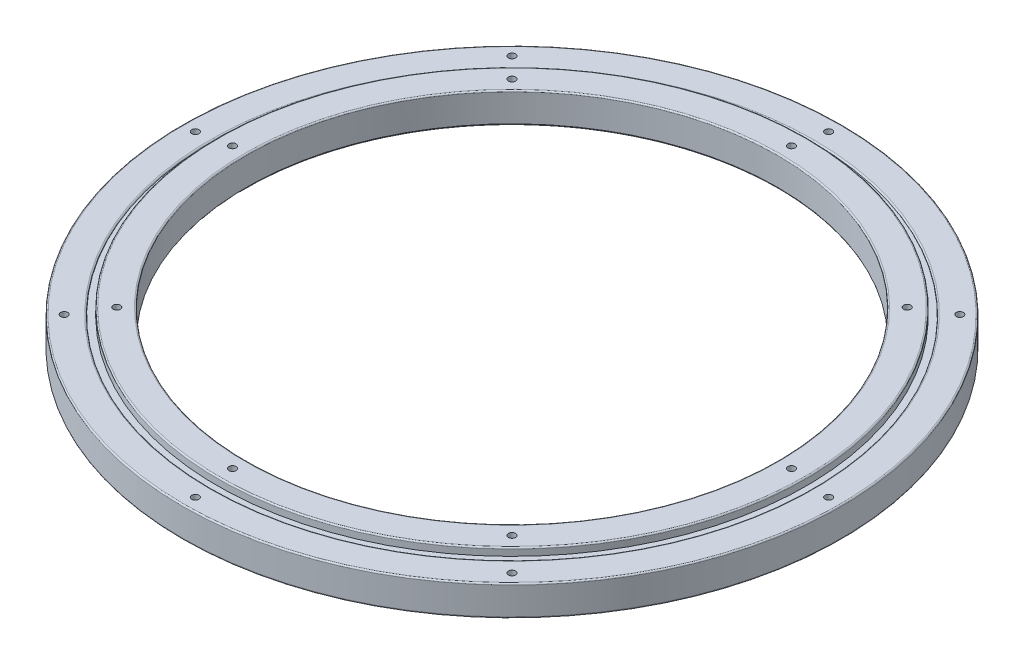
ISO-10303-21;
HEADER;
FILE_DESCRIPTION(('STEP AP214'),'2;1');
FILE_NAME('part.step','',(''),(''),'','','');
FILE_SCHEMA(('AUTOMOTIVE_DESIGN { 1 0 10303 214 1 1 1 1 }'));
ENDSEC;
DATA;
#1=APPLICATION_CONTEXT('core data for automotive mechanical design processes');
#2=APPLICATION_PROTOCOL_DEFINITION('international standard','automotive_design',2000,#1);
#3=PRODUCT_CONTEXT('',#1,'mechanical');
#4=PRODUCT('Part','Part','',(#3));
#5=PRODUCT_RELATED_PRODUCT_CATEGORY('part','',(#4));
#6=PRODUCT_DEFINITION_FORMATION('','',#4);
#7=PRODUCT_DEFINITION_CONTEXT('part definition',#1,'design');
#8=PRODUCT_DEFINITION('design','',#6,#7);
#9=PRODUCT_DEFINITION_SHAPE('','',#8);
#10=(LENGTH_UNIT() NAMED_UNIT(*) SI_UNIT(.MILLI.,.METRE.));
#11=(NAMED_UNIT(*) PLANE_ANGLE_UNIT() SI_UNIT($,.RADIAN.));
#12=(NAMED_UNIT(*) SI_UNIT($,.STERADIAN.) SOLID_ANGLE_UNIT());
#13=UNCERTAINTY_MEASURE_WITH_UNIT(LENGTH_MEASURE(1.E-05),#10,'distance_accuracy_value','');
#14=(GEOMETRIC_REPRESENTATION_CONTEXT(3) GLOBAL_UNCERTAINTY_ASSIGNED_CONTEXT((#13)) GLOBAL_UNIT_ASSIGNED_CONTEXT((#10,
#11,#12)) REPRESENTATION_CONTEXT('',''));
#15=CARTESIAN_POINT('',(0.,0.,0.));
#16=DIRECTION('',(0.,0.,1.));
#17=DIRECTION('',(1.,0.,0.));
#18=AXIS2_PLACEMENT_3D('',#15,#16,#17);
#19=CARTESIAN_POINT('',(-122.5169,16.9,0.));
#20=DIRECTION('',(0.,-1.,0.));
#21=DIRECTION('',(0.,0.,-1.));
#22=AXIS2_PLACEMENT_3D('',#19,#20,#21);
#23=PLANE('',#22);
#24=CARTESIAN_POINT('',(-91.1495996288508,16.9,91.149599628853));
#25=DIRECTION('',(0.,1.,0.));
#26=DIRECTION('',(0.,0.,1.));
#27=AXIS2_PLACEMENT_3D('',#24,#25,#26);
#28=CIRCLE('',#27,1.64999999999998);
#29=CARTESIAN_POINT('',(-91.1495996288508,16.9,92.799599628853));
#30=VERTEX_POINT('',#29);
#31=EDGE_CURVE('E731',#30,#30,#28,.T.);
#32=ORIENTED_EDGE('',*,*,#31,.F.);
#33=EDGE_LOOP('',(#32));
#34=FACE_BOUND('',#33,.T.);
#35=CARTESIAN_POINT('',(-128.905,16.9,1.35020820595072E-12));
#36=DIRECTION('',(0.,1.,0.));
#37=DIRECTION('',(0.,0.,1.));
#38=AXIS2_PLACEMENT_3D('',#35,#36,#37);
#39=CIRCLE('',#38,1.64999999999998);
#40=CARTESIAN_POINT('',(-128.905,16.9,1.65000000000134));
#41=VERTEX_POINT('',#40);
#42=EDGE_CURVE('E92',#41,#41,#39,.T.);
#43=ORIENTED_EDGE('',*,*,#42,.F.);
#44=EDGE_LOOP('',(#43));
#45=FACE_BOUND('',#44,.T.);
#46=CARTESIAN_POINT('',(-91.1495996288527,16.9,-91.1495996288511));
#47=DIRECTION('',(0.,1.,0.));
#48=DIRECTION('',(0.,0.,1.));
#49=AXIS2_PLACEMENT_3D('',#46,#47,#48);
#50=CIRCLE('',#49,1.64999999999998);
#51=CARTESIAN_POINT('',(-91.1495996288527,16.9,-89.4995996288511));
#52=VERTEX_POINT('',#51);
#53=EDGE_CURVE('E88',#52,#52,#50,.T.);
#54=ORIENTED_EDGE('',*,*,#53,.F.);
#55=EDGE_LOOP('',(#54));
#56=FACE_BOUND('',#55,.T.);
#57=CARTESIAN_POINT('',(0.,16.9,-128.905));
#58=DIRECTION('',(0.,1.,0.));
#59=DIRECTION('',(0.,0.,1.));
#60=AXIS2_PLACEMENT_3D('',#57,#58,#59);
#61=CIRCLE('',#60,1.64999999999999);
#62=CARTESIAN_POINT('',(0.,16.9,-127.255));
#63=VERTEX_POINT('',#62);
#64=EDGE_CURVE('E84',#63,#63,#61,.T.);
#65=ORIENTED_EDGE('',*,*,#64,.F.);
#66=EDGE_LOOP('',(#65));
#67=FACE_BOUND('',#66,.T.);
#68=CARTESIAN_POINT('',(91.1495996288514,16.9,-91.1495996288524));
#69=DIRECTION('',(0.,1.,0.));
#70=DIRECTION('',(0.,0.,1.));
#71=AXIS2_PLACEMENT_3D('',#68,#69,#70);
#72=CIRCLE('',#71,1.64999999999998);
#73=CARTESIAN_POINT('',(91.1495996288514,16.9,-89.4995996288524));
#74=VERTEX_POINT('',#73);
#75=EDGE_CURVE('E79',#74,#74,#72,.T.);
#76=ORIENTED_EDGE('',*,*,#75,.F.);
#77=EDGE_LOOP('',(#76));
#78=FACE_BOUND('',#77,.T.);
#79=CARTESIAN_POINT('',(128.905,16.9,-4.50069401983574E-13));
#80=DIRECTION('',(0.,1.,0.));
#81=DIRECTION('',(0.,0.,1.));
#82=AXIS2_PLACEMENT_3D('',#79,#80,#81);
#83=CIRCLE('',#82,1.64999999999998);
#84=CARTESIAN_POINT('',(128.905,16.9,1.64999999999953));
#85=VERTEX_POINT('',#84);
#86=EDGE_CURVE('E74',#85,#85,#83,.T.);
#87=ORIENTED_EDGE('',*,*,#86,.F.);
#88=EDGE_LOOP('',(#87));
#89=FACE_BOUND('',#88,.T.);
#90=CARTESIAN_POINT('',(91.1495996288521,16.9,91.1495996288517));
#91=DIRECTION('',(0.,1.,0.));
#92=DIRECTION('',(0.,0.,1.));
#93=AXIS2_PLACEMENT_3D('',#90,#91,#92);
#94=CIRCLE('',#93,1.64999999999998);
#95=CARTESIAN_POINT('',(91.1495996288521,16.9,92.7995996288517));
#96=VERTEX_POINT('',#95);
#97=EDGE_CURVE('E69',#96,#96,#94,.T.);
#98=ORIENTED_EDGE('',*,*,#97,.F.);
#99=EDGE_LOOP('',(#98));
#100=FACE_BOUND('',#99,.T.);
#101=CARTESIAN_POINT('',(0.,16.9,128.905));
#102=DIRECTION('',(0.,1.,0.));
#103=DIRECTION('',(0.,0.,1.));
#104=AXIS2_PLACEMENT_3D('',#101,#102,#103);
#105=CIRCLE('',#104,1.64999999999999);
#106=CARTESIAN_POINT('',(0.,16.9,130.555));
#107=VERTEX_POINT('',#106);
#108=EDGE_CURVE('E64',#107,#107,#105,.T.);
#109=ORIENTED_EDGE('',*,*,#108,.F.);
#110=EDGE_LOOP('',(#109));
#111=FACE_BOUND('',#110,.T.);
#112=CARTESIAN_POINT('',(0.,16.9,0.));
#113=DIRECTION('',(0.,-1.,0.));
#114=DIRECTION('',(0.,0.,-1.));
#115=AXIS2_PLACEMENT_3D('',#112,#113,#114);
#116=CIRCLE('',#115,135.14255);
#117=CARTESIAN_POINT('',(0.,16.9,-135.14255));
#118=VERTEX_POINT('',#117);
#119=EDGE_CURVE('E164',#118,#118,#116,.F.);
#120=ORIENTED_EDGE('',*,*,#119,.T.);
#121=EDGE_LOOP('',(#120));
#122=FACE_BOUND('',#121,.T.);
#123=CARTESIAN_POINT('',(0.,16.9,0.));
#124=DIRECTION('',(0.,-1.,0.));
#125=DIRECTION('',(0.,0.,-1.));
#126=AXIS2_PLACEMENT_3D('',#123,#124,#125);
#127=CIRCLE('',#126,123.1519);
#128=CARTESIAN_POINT('',(0.,16.9,-123.1519));
#129=VERTEX_POINT('',#128);
#130=EDGE_CURVE('E161',#129,#129,#127,.T.);
#131=ORIENTED_EDGE('',*,*,#130,.T.);
#132=EDGE_LOOP('',(#131));
#133=FACE_BOUND('',#132,.T.);
#134=ADVANCED_FACE('F43',(#34,#45,#56,#67,#78,#89,#100,#111,#122,#133),#23,.F.);
#135=CARTESIAN_POINT('',(0.,0.,0.));
#136=DIRECTION('',(0.,-1.,0.));
#137=DIRECTION('',(0.,0.,-1.));
#138=AXIS2_PLACEMENT_3D('',#135,#136,#137);
#139=CYLINDRICAL_SURFACE('',#138,122.5169);
#140=CARTESIAN_POINT('',(0.,3.535,0.));
#141=DIRECTION('',(0.,1.,0.));
#142=DIRECTION('',(0.,0.,1.));
#143=AXIS2_PLACEMENT_3D('',#140,#141,#142);
#144=CIRCLE('',#143,122.5169);
#145=CARTESIAN_POINT('',(0.,3.535,122.5169));
#146=VERTEX_POINT('',#145);
#147=EDGE_CURVE('E170',#146,#146,#144,.F.);
#148=ORIENTED_EDGE('',*,*,#147,.T.);
#149=EDGE_LOOP('',(#148));
#150=FACE_BOUND('',#149,.T.);
#151=CARTESIAN_POINT('',(0.,16.265,0.));
#152=DIRECTION('',(0.,-1.,0.));
#153=DIRECTION('',(0.,0.,-1.));
#154=AXIS2_PLACEMENT_3D('',#151,#152,#153);
#155=CIRCLE('',#154,122.5169);
#156=CARTESIAN_POINT('',(0.,16.265,-122.5169));
#157=VERTEX_POINT('',#156);
#158=EDGE_CURVE('E167',#157,#157,#155,.F.);
#159=ORIENTED_EDGE('',*,*,#158,.T.);
#160=EDGE_LOOP('',(#159));
#161=FACE_BOUND('',#160,.T.);
#162=ADVANCED_FACE('F209',(#150,#161),#139,.F.);
#163=CARTESIAN_POINT('',(0.,0.,0.));
#164=DIRECTION('',(0.,-1.,0.));
#165=DIRECTION('',(0.,0.,-1.));
#166=AXIS2_PLACEMENT_3D('',#163,#164,#165);
#167=CYLINDRICAL_SURFACE('',#166,135.77755);
#168=CARTESIAN_POINT('',(0.,16.265,0.));
#169=DIRECTION('',(0.,-1.,0.));
#170=DIRECTION('',(0.,0.,-1.));
#171=AXIS2_PLACEMENT_3D('',#168,#169,#170);
#172=CIRCLE('',#171,135.77755);
#173=CARTESIAN_POINT('',(0.,16.265,-135.77755));
#174=VERTEX_POINT('',#173);
#175=EDGE_CURVE('E158',#174,#174,#172,.T.);
#176=ORIENTED_EDGE('',*,*,#175,.T.);
#177=EDGE_LOOP('',(#176));
#178=FACE_BOUND('',#177,.T.);
#179=CARTESIAN_POINT('',(0.,13.365,0.));
#180=DIRECTION('',(0.,-1.,0.));
#181=DIRECTION('',(0.,0.,-1.));
#182=AXIS2_PLACEMENT_3D('',#179,#180,#181);
#183=CIRCLE('',#182,135.77755);
#184=CARTESIAN_POINT('',(0.,13.365,-135.77755));
#185=VERTEX_POINT('',#184);
#186=EDGE_CURVE('E155',#185,#185,#183,.T.);
#187=ORIENTED_EDGE('',*,*,#186,.F.);
#188=EDGE_LOOP('',(#187));
#189=FACE_BOUND('',#188,.T.);
#190=ADVANCED_FACE('F215',(#178,#189),#167,.T.);
#191=CARTESIAN_POINT('',(-138.74935,13.365,0.));
#192=DIRECTION('',(0.,-1.,0.));
#193=DIRECTION('',(0.,0.,-1.));
#194=AXIS2_PLACEMENT_3D('',#191,#192,#193);
#195=PLANE('',#194);
#196=CARTESIAN_POINT('',(0.,13.365,0.));
#197=DIRECTION('',(0.,-1.,0.));
#198=DIRECTION('',(0.,0.,-1.));
#199=AXIS2_PLACEMENT_3D('',#196,#197,#198);
#200=CIRCLE('',#199,138.74935);
#201=CARTESIAN_POINT('',(0.,13.365,-138.74935));
#202=VERTEX_POINT('',#201);
#203=EDGE_CURVE('E152',#202,#202,#200,.T.);
#204=ORIENTED_EDGE('',*,*,#203,.F.);
#205=EDGE_LOOP('',(#204));
#206=FACE_BOUND('',#205,.T.);
#207=ORIENTED_EDGE('',*,*,#186,.T.);
#208=EDGE_LOOP('',(#207));
#209=FACE_BOUND('',#208,.T.);
#210=ADVANCED_FACE('F267',(#206,#209),#195,.F.);
#211=CARTESIAN_POINT('',(-138.74935,14.,0.));
#212=DIRECTION('',(0.,-1.,0.));
#213=DIRECTION('',(0.,0.,-1.));
#214=AXIS2_PLACEMENT_3D('',#211,#212,#213);
#215=PLANE('',#214);
#216=CARTESIAN_POINT('',(-103.272945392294,14.,103.272945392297));
#217=DIRECTION('',(0.,-1.,0.));
#218=DIRECTION('',(0.,0.,-1.));
#219=AXIS2_PLACEMENT_3D('',#216,#217,#218);
#220=CIRCLE('',#219,1.64999999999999);
#221=CARTESIAN_POINT('',(-103.272945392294,14.,101.622945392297));
#222=VERTEX_POINT('',#221);
#223=EDGE_CURVE('E730',#222,#222,#220,.T.);
#224=ORIENTED_EDGE('',*,*,#223,.T.);
#225=EDGE_LOOP('',(#224));
#226=FACE_BOUND('',#225,.T.);
#227=CARTESIAN_POINT('',(-146.05,14.,1.52979254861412E-12));
#228=DIRECTION('',(0.,-1.,0.));
#229=DIRECTION('',(0.,0.,-1.));
#230=AXIS2_PLACEMENT_3D('',#227,#228,#229);
#231=CIRCLE('',#230,1.64999999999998);
#232=CARTESIAN_POINT('',(-146.05,14.,-1.64999999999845));
#233=VERTEX_POINT('',#232);
#234=EDGE_CURVE('E99',#233,#233,#231,.T.);
#235=ORIENTED_EDGE('',*,*,#234,.T.);
#236=EDGE_LOOP('',(#235));
#237=FACE_BOUND('',#236,.T.);
#238=CARTESIAN_POINT('',(-103.272945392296,14.,-103.272945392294));
#239=DIRECTION('',(0.,-1.,0.));
#240=DIRECTION('',(0.,0.,-1.));
#241=AXIS2_PLACEMENT_3D('',#238,#239,#240);
#242=CIRCLE('',#241,1.64999999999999);
#243=CARTESIAN_POINT('',(-103.272945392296,14.,-104.922945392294));
#244=VERTEX_POINT('',#243);
#245=EDGE_CURVE('E96',#244,#244,#242,.T.);
#246=ORIENTED_EDGE('',*,*,#245,.T.);
#247=EDGE_LOOP('',(#246));
#248=FACE_BOUND('',#247,.T.);
#249=CARTESIAN_POINT('',(0.,14.,-146.05));
#250=DIRECTION('',(0.,-1.,0.));
#251=DIRECTION('',(0.,0.,-1.));
#252=AXIS2_PLACEMENT_3D('',#249,#250,#251);
#253=CIRCLE('',#252,1.64999999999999);
#254=CARTESIAN_POINT('',(0.,14.,-147.7));
#255=VERTEX_POINT('',#254);
#256=EDGE_CURVE('E114',#255,#255,#253,.T.);
#257=ORIENTED_EDGE('',*,*,#256,.T.);
#258=EDGE_LOOP('',(#257));
#259=FACE_BOUND('',#258,.T.);
#260=CARTESIAN_POINT('',(103.272945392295,14.,-103.272945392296));
#261=DIRECTION('',(0.,-1.,0.));
#262=DIRECTION('',(0.,0.,-1.));
#263=AXIS2_PLACEMENT_3D('',#260,#261,#262);
#264=CIRCLE('',#263,1.64999999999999);
#265=CARTESIAN_POINT('',(103.272945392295,14.,-104.922945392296));
#266=VERTEX_POINT('',#265);
#267=EDGE_CURVE('E121',#266,#266,#264,.T.);
#268=ORIENTED_EDGE('',*,*,#267,.T.);
#269=EDGE_LOOP('',(#268));
#270=FACE_BOUND('',#269,.T.);
#271=CARTESIAN_POINT('',(146.05,14.,-5.0993084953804E-13));
#272=DIRECTION('',(0.,-1.,0.));
#273=DIRECTION('',(0.,0.,-1.));
#274=AXIS2_PLACEMENT_3D('',#271,#272,#273);
#275=CIRCLE('',#274,1.64999999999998);
#276=CARTESIAN_POINT('',(146.05,14.,-1.65000000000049));
#277=VERTEX_POINT('',#276);
#278=EDGE_CURVE('E128',#277,#277,#275,.T.);
#279=ORIENTED_EDGE('',*,*,#278,.T.);
#280=EDGE_LOOP('',(#279));
#281=FACE_BOUND('',#280,.T.);
#282=CARTESIAN_POINT('',(103.272945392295,14.,103.272945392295));
#283=DIRECTION('',(0.,-1.,0.));
#284=DIRECTION('',(0.,0.,-1.));
#285=AXIS2_PLACEMENT_3D('',#282,#283,#284);
#286=CIRCLE('',#285,1.64999999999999);
#287=CARTESIAN_POINT('',(103.272945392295,14.,101.622945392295));
#288=VERTEX_POINT('',#287);
#289=EDGE_CURVE('E135',#288,#288,#286,.T.);
#290=ORIENTED_EDGE('',*,*,#289,.T.);
#291=EDGE_LOOP('',(#290));
#292=FACE_BOUND('',#291,.T.);
#293=CARTESIAN_POINT('',(0.,14.,146.05));
#294=DIRECTION('',(0.,-1.,0.));
#295=DIRECTION('',(0.,0.,-1.));
#296=AXIS2_PLACEMENT_3D('',#293,#294,#295);
#297=CIRCLE('',#296,1.64999999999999);
#298=CARTESIAN_POINT('',(0.,14.,144.4));
#299=VERTEX_POINT('',#298);
#300=EDGE_CURVE('E142',#299,#299,#297,.T.);
#301=ORIENTED_EDGE('',*,*,#300,.T.);
#302=EDGE_LOOP('',(#301));
#303=FACE_BOUND('',#302,.T.);
#304=CARTESIAN_POINT('',(0.,14.,0.));
#305=DIRECTION('',(0.,-1.,0.));
#306=DIRECTION('',(0.,0.,-1.));
#307=AXIS2_PLACEMENT_3D('',#304,#305,#306);
#308=CIRCLE('',#307,151.375);
#309=CARTESIAN_POINT('',(0.,14.,-151.375));
#310=VERTEX_POINT('',#309);
#311=EDGE_CURVE('E188',#310,#310,#308,.F.);
#312=ORIENTED_EDGE('',*,*,#311,.T.);
#313=EDGE_LOOP('',(#312));
#314=FACE_BOUND('',#313,.T.);
#315=CARTESIAN_POINT('',(0.,14.,0.));
#316=DIRECTION('',(0.,-1.,0.));
#317=DIRECTION('',(0.,0.,-1.));
#318=AXIS2_PLACEMENT_3D('',#315,#316,#317);
#319=CIRCLE('',#318,139.38435);
#320=CARTESIAN_POINT('',(0.,14.,-139.38435));
#321=VERTEX_POINT('',#320);
#322=EDGE_CURVE('E185',#321,#321,#319,.T.);
#323=ORIENTED_EDGE('',*,*,#322,.T.);
#324=EDGE_LOOP('',(#323));
#325=FACE_BOUND('',#324,.T.);
#326=ADVANCED_FACE('F259',(#226,#237,#248,#259,#270,#281,#292,#303,#314,#325),#215,.F.);
#327=CARTESIAN_POINT('',(0.,0.,0.));
#328=DIRECTION('',(0.,-1.,0.));
#329=DIRECTION('',(0.,0.,-1.));
#330=AXIS2_PLACEMENT_3D('',#327,#328,#329);
#331=CYLINDRICAL_SURFACE('',#330,152.01);
#332=CARTESIAN_POINT('',(0.,13.365,0.));
#333=DIRECTION('',(0.,-1.,0.));
#334=DIRECTION('',(0.,0.,-1.));
#335=AXIS2_PLACEMENT_3D('',#332,#333,#334);
#336=CIRCLE('',#335,152.01);
#337=CARTESIAN_POINT('',(0.,13.365,-152.01));
#338=VERTEX_POINT('',#337);
#339=EDGE_CURVE('E182',#338,#338,#336,.T.);
#340=ORIENTED_EDGE('',*,*,#339,.T.);
#341=EDGE_LOOP('',(#340));
#342=FACE_BOUND('',#341,.T.);
#343=CARTESIAN_POINT('',(0.,0.635,0.));
#344=DIRECTION('',(0.,1.,0.));
#345=DIRECTION('',(0.,0.,1.));
#346=AXIS2_PLACEMENT_3D('',#343,#344,#345);
#347=CIRCLE('',#346,152.01);
#348=CARTESIAN_POINT('',(0.,0.635,152.01));
#349=VERTEX_POINT('',#348);
#350=EDGE_CURVE('E179',#349,#349,#347,.T.);
#351=ORIENTED_EDGE('',*,*,#350,.T.);
#352=EDGE_LOOP('',(#351));
#353=FACE_BOUND('',#352,.T.);
#354=ADVANCED_FACE('F250',(#342,#353),#331,.T.);
#355=CARTESIAN_POINT('',(-152.01,0.,0.));
#356=DIRECTION('',(0.,1.,0.));
#357=DIRECTION('',(0.,0.,1.));
#358=AXIS2_PLACEMENT_3D('',#355,#356,#357);
#359=PLANE('',#358);
#360=CARTESIAN_POINT('',(-103.272945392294,0.,103.272945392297));
#361=DIRECTION('',(0.,1.,0.));
#362=DIRECTION('',(0.,0.,1.));
#363=AXIS2_PLACEMENT_3D('',#360,#361,#362);
#364=CIRCLE('',#363,1.65);
#365=CARTESIAN_POINT('',(-103.272945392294,0.,104.922945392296));
#366=VERTEX_POINT('',#365);
#367=EDGE_CURVE('E727',#366,#366,#364,.T.);
#368=ORIENTED_EDGE('',*,*,#367,.T.);
#369=EDGE_LOOP('',(#368));
#370=FACE_BOUND('',#369,.T.);
#371=CARTESIAN_POINT('',(-146.05,0.,1.52979254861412E-12));
#372=DIRECTION('',(0.,1.,0.));
#373=DIRECTION('',(0.,0.,1.));
#374=AXIS2_PLACEMENT_3D('',#371,#372,#373);
#375=CIRCLE('',#374,1.64999999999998);
#376=CARTESIAN_POINT('',(-146.05,0.,1.65000000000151));
#377=VERTEX_POINT('',#376);
#378=EDGE_CURVE('E104',#377,#377,#375,.T.);
#379=ORIENTED_EDGE('',*,*,#378,.T.);
#380=EDGE_LOOP('',(#379));
#381=FACE_BOUND('',#380,.T.);
#382=CARTESIAN_POINT('',(-103.272945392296,0.,-103.272945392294));
#383=DIRECTION('',(0.,1.,0.));
#384=DIRECTION('',(0.,0.,1.));
#385=AXIS2_PLACEMENT_3D('',#382,#383,#384);
#386=CIRCLE('',#385,1.65);
#387=CARTESIAN_POINT('',(-103.272945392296,0.,-101.622945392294));
#388=VERTEX_POINT('',#387);
#389=EDGE_CURVE('E91',#388,#388,#386,.T.);
#390=ORIENTED_EDGE('',*,*,#389,.T.);
#391=EDGE_LOOP('',(#390));
#392=FACE_BOUND('',#391,.T.);
#393=CARTESIAN_POINT('',(0.,0.,-146.05));
#394=DIRECTION('',(0.,1.,0.));
#395=DIRECTION('',(0.,0.,1.));
#396=AXIS2_PLACEMENT_3D('',#393,#394,#395);
#397=CIRCLE('',#396,1.65);
#398=CARTESIAN_POINT('',(0.,0.,-144.4));
#399=VERTEX_POINT('',#398);
#400=EDGE_CURVE('E87',#399,#399,#397,.T.);
#401=ORIENTED_EDGE('',*,*,#400,.T.);
#402=EDGE_LOOP('',(#401));
#403=FACE_BOUND('',#402,.T.);
#404=CARTESIAN_POINT('',(103.272945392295,0.,-103.272945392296));
#405=DIRECTION('',(0.,1.,0.));
#406=DIRECTION('',(0.,0.,1.));
#407=AXIS2_PLACEMENT_3D('',#404,#405,#406);
#408=CIRCLE('',#407,1.65);
#409=CARTESIAN_POINT('',(103.272945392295,0.,-101.622945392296));
#410=VERTEX_POINT('',#409);
#411=EDGE_CURVE('E83',#410,#410,#408,.T.);
#412=ORIENTED_EDGE('',*,*,#411,.T.);
#413=EDGE_LOOP('',(#412));
#414=FACE_BOUND('',#413,.T.);
#415=CARTESIAN_POINT('',(146.05,0.,-5.0993084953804E-13));
#416=DIRECTION('',(0.,1.,0.));
#417=DIRECTION('',(0.,0.,1.));
#418=AXIS2_PLACEMENT_3D('',#415,#416,#417);
#419=CIRCLE('',#418,1.64999999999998);
#420=CARTESIAN_POINT('',(146.05,0.,1.64999999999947));
#421=VERTEX_POINT('',#420);
#422=EDGE_CURVE('E78',#421,#421,#419,.T.);
#423=ORIENTED_EDGE('',*,*,#422,.T.);
#424=EDGE_LOOP('',(#423));
#425=FACE_BOUND('',#424,.T.);
#426=CARTESIAN_POINT('',(103.272945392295,0.,103.272945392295));
#427=DIRECTION('',(0.,1.,0.));
#428=DIRECTION('',(0.,0.,1.));
#429=AXIS2_PLACEMENT_3D('',#426,#427,#428);
#430=CIRCLE('',#429,1.65);
#431=CARTESIAN_POINT('',(103.272945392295,0.,104.922945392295));
#432=VERTEX_POINT('',#431);
#433=EDGE_CURVE('E73',#432,#432,#430,.T.);
#434=ORIENTED_EDGE('',*,*,#433,.T.);
#435=EDGE_LOOP('',(#434));
#436=FACE_BOUND('',#435,.T.);
#437=CARTESIAN_POINT('',(0.,0.,146.05));
#438=DIRECTION('',(0.,1.,0.));
#439=DIRECTION('',(0.,0.,1.));
#440=AXIS2_PLACEMENT_3D('',#437,#438,#439);
#441=CIRCLE('',#440,1.65);
#442=CARTESIAN_POINT('',(0.,0.,147.7));
#443=VERTEX_POINT('',#442);
#444=EDGE_CURVE('E68',#443,#443,#441,.T.);
#445=ORIENTED_EDGE('',*,*,#444,.T.);
#446=EDGE_LOOP('',(#445));
#447=FACE_BOUND('',#446,.T.);
#448=CARTESIAN_POINT('',(0.,0.,0.));
#449=DIRECTION('',(0.,1.,0.));
#450=DIRECTION('',(0.,0.,1.));
#451=AXIS2_PLACEMENT_3D('',#448,#449,#450);
#452=CIRCLE('',#451,151.375);
#453=CARTESIAN_POINT('',(0.,0.,151.375));
#454=VERTEX_POINT('',#453);
#455=EDGE_CURVE('E51',#454,#454,#452,.F.);
#456=ORIENTED_EDGE('',*,*,#455,.T.);
#457=EDGE_LOOP('',(#456));
#458=FACE_BOUND('',#457,.T.);
#459=CARTESIAN_POINT('',(0.,0.,0.));
#460=DIRECTION('',(0.,1.,0.));
#461=DIRECTION('',(0.,0.,1.));
#462=AXIS2_PLACEMENT_3D('',#459,#460,#461);
#463=CIRCLE('',#462,139.38435);
#464=CARTESIAN_POINT('',(0.,0.,139.38435));
#465=VERTEX_POINT('',#464);
#466=EDGE_CURVE('E56',#465,#465,#463,.T.);
#467=ORIENTED_EDGE('',*,*,#466,.T.);
#468=EDGE_LOOP('',(#467));
#469=FACE_BOUND('',#468,.T.);
#470=ADVANCED_FACE('F193',(#370,#381,#392,#403,#414,#425,#436,#447,#458,#469),#359,.F.);
#471=CARTESIAN_POINT('',(0.,0.,0.));
#472=DIRECTION('',(0.,-1.,0.));
#473=DIRECTION('',(0.,0.,-1.));
#474=AXIS2_PLACEMENT_3D('',#471,#472,#473);
#475=CYLINDRICAL_SURFACE('',#474,138.74935);
#476=CARTESIAN_POINT('',(0.,0.635,0.));
#477=DIRECTION('',(0.,1.,0.));
#478=DIRECTION('',(0.,0.,1.));
#479=AXIS2_PLACEMENT_3D('',#476,#477,#478);
#480=CIRCLE('',#479,138.74935);
#481=CARTESIAN_POINT('',(0.,0.635,138.74935));
#482=VERTEX_POINT('',#481);
#483=EDGE_CURVE('E10',#482,#482,#480,.F.);
#484=ORIENTED_EDGE('',*,*,#483,.T.);
#485=EDGE_LOOP('',(#484));
#486=FACE_BOUND('',#485,.T.);
#487=CARTESIAN_POINT('',(0.,3.535,0.));
#488=DIRECTION('',(0.,-1.,0.));
#489=DIRECTION('',(0.,0.,-1.));
#490=AXIS2_PLACEMENT_3D('',#487,#488,#489);
#491=CIRCLE('',#490,138.74935);
#492=CARTESIAN_POINT('',(0.,3.535,-138.74935));
#493=VERTEX_POINT('',#492);
#494=EDGE_CURVE('E149',#493,#493,#491,.T.);
#495=ORIENTED_EDGE('',*,*,#494,.F.);
#496=EDGE_LOOP('',(#495));
#497=FACE_BOUND('',#496,.T.);
#498=ADVANCED_FACE('F249',(#486,#497),#475,.F.);
#499=CARTESIAN_POINT('',(-135.77755,3.535,0.));
#500=DIRECTION('',(0.,1.,0.));
#501=DIRECTION('',(0.,0.,1.));
#502=AXIS2_PLACEMENT_3D('',#499,#500,#501);
#503=PLANE('',#502);
#504=CARTESIAN_POINT('',(0.,3.535,0.));
#505=DIRECTION('',(0.,-1.,0.));
#506=DIRECTION('',(0.,0.,-1.));
#507=AXIS2_PLACEMENT_3D('',#504,#505,#506);
#508=CIRCLE('',#507,135.77755);
#509=CARTESIAN_POINT('',(0.,3.535,-135.77755));
#510=VERTEX_POINT('',#509);
#511=EDGE_CURVE('E63',#510,#510,#508,.T.);
#512=ORIENTED_EDGE('',*,*,#511,.F.);
#513=EDGE_LOOP('',(#512));
#514=FACE_BOUND('',#513,.T.);
#515=ORIENTED_EDGE('',*,*,#494,.T.);
#516=EDGE_LOOP('',(#515));
#517=FACE_BOUND('',#516,.T.);
#518=ADVANCED_FACE('F257',(#514,#517),#503,.F.);
#519=CARTESIAN_POINT('',(-135.77755,2.9,0.));
#520=DIRECTION('',(0.,1.,0.));
#521=DIRECTION('',(0.,0.,1.));
#522=AXIS2_PLACEMENT_3D('',#519,#520,#521);
#523=PLANE('',#522);
#524=CARTESIAN_POINT('',(-91.1495996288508,2.9,91.149599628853));
#525=DIRECTION('',(0.,1.,0.));
#526=DIRECTION('',(0.,0.,1.));
#527=AXIS2_PLACEMENT_3D('',#524,#525,#526);
#528=CIRCLE('',#527,1.64999999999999);
#529=CARTESIAN_POINT('',(-91.1495996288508,2.9,92.799599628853));
#530=VERTEX_POINT('',#529);
#531=EDGE_CURVE('E47',#530,#530,#528,.T.);
#532=ORIENTED_EDGE('',*,*,#531,.T.);
#533=EDGE_LOOP('',(#532));
#534=FACE_BOUND('',#533,.T.);
#535=CARTESIAN_POINT('',(-128.905,2.9,1.35020820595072E-12));
#536=DIRECTION('',(0.,1.,0.));
#537=DIRECTION('',(0.,0.,1.));
#538=AXIS2_PLACEMENT_3D('',#535,#536,#537);
#539=CIRCLE('',#538,1.64999999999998);
#540=CARTESIAN_POINT('',(-128.905,2.9,1.65000000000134));
#541=VERTEX_POINT('',#540);
#542=EDGE_CURVE('E89',#541,#541,#539,.T.);
#543=ORIENTED_EDGE('',*,*,#542,.T.);
#544=EDGE_LOOP('',(#543));
#545=FACE_BOUND('',#544,.T.);
#546=CARTESIAN_POINT('',(-91.1495996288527,2.9,-91.1495996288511));
#547=DIRECTION('',(0.,1.,0.));
#548=DIRECTION('',(0.,0.,1.));
#549=AXIS2_PLACEMENT_3D('',#546,#547,#548);
#550=CIRCLE('',#549,1.64999999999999);
#551=CARTESIAN_POINT('',(-91.1495996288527,2.9,-89.4995996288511));
#552=VERTEX_POINT('',#551);
#553=EDGE_CURVE('E85',#552,#552,#550,.T.);
#554=ORIENTED_EDGE('',*,*,#553,.T.);
#555=EDGE_LOOP('',(#554));
#556=FACE_BOUND('',#555,.T.);
#557=CARTESIAN_POINT('',(0.,2.9,-128.905));
#558=DIRECTION('',(0.,1.,0.));
#559=DIRECTION('',(0.,0.,1.));
#560=AXIS2_PLACEMENT_3D('',#557,#558,#559);
#561=CIRCLE('',#560,1.64999999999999);
#562=CARTESIAN_POINT('',(0.,2.9,-127.255));
#563=VERTEX_POINT('',#562);
#564=EDGE_CURVE('E80',#563,#563,#561,.T.);
#565=ORIENTED_EDGE('',*,*,#564,.T.);
#566=EDGE_LOOP('',(#565));
#567=FACE_BOUND('',#566,.T.);
#568=CARTESIAN_POINT('',(91.1495996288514,2.9,-91.1495996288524));
#569=DIRECTION('',(0.,1.,0.));
#570=DIRECTION('',(0.,0.,1.));
#571=AXIS2_PLACEMENT_3D('',#568,#569,#570);
#572=CIRCLE('',#571,1.64999999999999);
#573=CARTESIAN_POINT('',(91.1495996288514,2.9,-89.4995996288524));
#574=VERTEX_POINT('',#573);
#575=EDGE_CURVE('E75',#574,#574,#572,.T.);
#576=ORIENTED_EDGE('',*,*,#575,.T.);
#577=EDGE_LOOP('',(#576));
#578=FACE_BOUND('',#577,.T.);
#579=CARTESIAN_POINT('',(128.905,2.9,-4.50069401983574E-13));
#580=DIRECTION('',(0.,1.,0.));
#581=DIRECTION('',(0.,0.,1.));
#582=AXIS2_PLACEMENT_3D('',#579,#580,#581);
#583=CIRCLE('',#582,1.64999999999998);
#584=CARTESIAN_POINT('',(128.905,2.9,1.64999999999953));
#585=VERTEX_POINT('',#584);
#586=EDGE_CURVE('E70',#585,#585,#583,.T.);
#587=ORIENTED_EDGE('',*,*,#586,.T.);
#588=EDGE_LOOP('',(#587));
#589=FACE_BOUND('',#588,.T.);
#590=CARTESIAN_POINT('',(91.1495996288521,2.9,91.1495996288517));
#591=DIRECTION('',(0.,1.,0.));
#592=DIRECTION('',(0.,0.,1.));
#593=AXIS2_PLACEMENT_3D('',#590,#591,#592);
#594=CIRCLE('',#593,1.64999999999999);
#595=CARTESIAN_POINT('',(91.1495996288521,2.9,92.7995996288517));
#596=VERTEX_POINT('',#595);
#597=EDGE_CURVE('E65',#596,#596,#594,.T.);
#598=ORIENTED_EDGE('',*,*,#597,.T.);
#599=EDGE_LOOP('',(#598));
#600=FACE_BOUND('',#599,.T.);
#601=CARTESIAN_POINT('',(0.,2.9,128.905));
#602=DIRECTION('',(0.,1.,0.));
#603=DIRECTION('',(0.,0.,1.));
#604=AXIS2_PLACEMENT_3D('',#601,#602,#603);
#605=CIRCLE('',#604,1.64999999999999);
#606=CARTESIAN_POINT('',(0.,2.9,130.555));
#607=VERTEX_POINT('',#606);
#608=EDGE_CURVE('E60',#607,#607,#605,.T.);
#609=ORIENTED_EDGE('',*,*,#608,.T.);
#610=EDGE_LOOP('',(#609));
#611=FACE_BOUND('',#610,.T.);
#612=CARTESIAN_POINT('',(0.,2.9,0.));
#613=DIRECTION('',(0.,1.,0.));
#614=DIRECTION('',(0.,0.,1.));
#615=AXIS2_PLACEMENT_3D('',#612,#613,#614);
#616=CIRCLE('',#615,123.1519);
#617=CARTESIAN_POINT('',(0.,2.9,123.1519));
#618=VERTEX_POINT('',#617);
#619=EDGE_CURVE('E176',#618,#618,#616,.T.);
#620=ORIENTED_EDGE('',*,*,#619,.T.);
#621=EDGE_LOOP('',(#620));
#622=FACE_BOUND('',#621,.T.);
#623=CARTESIAN_POINT('',(0.,2.9,0.));
#624=DIRECTION('',(0.,1.,0.));
#625=DIRECTION('',(0.,0.,1.));
#626=AXIS2_PLACEMENT_3D('',#623,#624,#625);
#627=CIRCLE('',#626,135.14255);
#628=CARTESIAN_POINT('',(0.,2.9,135.14255));
#629=VERTEX_POINT('',#628);
#630=EDGE_CURVE('E173',#629,#629,#627,.F.);
#631=ORIENTED_EDGE('',*,*,#630,.T.);
#632=EDGE_LOOP('',(#631));
#633=FACE_BOUND('',#632,.T.);
#634=ADVANCED_FACE('F227',(#534,#545,#556,#567,#578,#589,#600,#611,#622,#633),#523,.F.);
#635=CARTESIAN_POINT('',(0.,16.265,0.));
#636=DIRECTION('',(0.,-1.,0.));
#637=DIRECTION('',(0.,0.,-1.));
#638=AXIS2_PLACEMENT_3D('',#635,#636,#637);
#639=TOROIDAL_SURFACE('',#638,135.14255,0.635);
#640=ORIENTED_EDGE('',*,*,#119,.F.);
#641=EDGE_LOOP('',(#640));
#642=FACE_BOUND('',#641,.T.);
#643=ORIENTED_EDGE('',*,*,#175,.F.);
#644=EDGE_LOOP('',(#643));
#645=FACE_BOUND('',#644,.T.);
#646=ADVANCED_FACE('F223',(#642,#645),#639,.T.);
#647=CARTESIAN_POINT('',(0.,3.535,0.));
#648=DIRECTION('',(0.,1.,0.));
#649=DIRECTION('',(0.,0.,1.));
#650=AXIS2_PLACEMENT_3D('',#647,#648,#649);
#651=TOROIDAL_SURFACE('',#650,123.1519,0.635);
#652=ORIENTED_EDGE('',*,*,#619,.F.);
#653=EDGE_LOOP('',(#652));
#654=FACE_BOUND('',#653,.T.);
#655=ORIENTED_EDGE('',*,*,#147,.F.);
#656=EDGE_LOOP('',(#655));
#657=FACE_BOUND('',#656,.T.);
#658=ADVANCED_FACE('F226',(#654,#657),#651,.T.);
#659=CARTESIAN_POINT('',(0.,16.265,0.));
#660=DIRECTION('',(0.,-1.,0.));
#661=DIRECTION('',(0.,0.,-1.));
#662=AXIS2_PLACEMENT_3D('',#659,#660,#661);
#663=TOROIDAL_SURFACE('',#662,123.1519,0.635);
#664=ORIENTED_EDGE('',*,*,#158,.F.);
#665=EDGE_LOOP('',(#664));
#666=FACE_BOUND('',#665,.T.);
#667=ORIENTED_EDGE('',*,*,#130,.F.);
#668=EDGE_LOOP('',(#667));
#669=FACE_BOUND('',#668,.T.);
#670=ADVANCED_FACE('F231',(#666,#669),#663,.T.);
#671=CARTESIAN_POINT('',(0.,13.365,0.));
#672=DIRECTION('',(0.,-1.,0.));
#673=DIRECTION('',(0.,0.,-1.));
#674=AXIS2_PLACEMENT_3D('',#671,#672,#673);
#675=TOROIDAL_SURFACE('',#674,151.375,0.635);
#676=ORIENTED_EDGE('',*,*,#311,.F.);
#677=EDGE_LOOP('',(#676));
#678=FACE_BOUND('',#677,.T.);
#679=ORIENTED_EDGE('',*,*,#339,.F.);
#680=EDGE_LOOP('',(#679));
#681=FACE_BOUND('',#680,.T.);
#682=ADVANCED_FACE('F235',(#678,#681),#675,.T.);
#683=CARTESIAN_POINT('',(0.,0.635,0.));
#684=DIRECTION('',(0.,1.,0.));
#685=DIRECTION('',(0.,0.,1.));
#686=AXIS2_PLACEMENT_3D('',#683,#684,#685);
#687=TOROIDAL_SURFACE('',#686,151.375,0.635);
#688=ORIENTED_EDGE('',*,*,#350,.F.);
#689=EDGE_LOOP('',(#688));
#690=FACE_BOUND('',#689,.T.);
#691=ORIENTED_EDGE('',*,*,#455,.F.);
#692=EDGE_LOOP('',(#691));
#693=FACE_BOUND('',#692,.T.);
#694=ADVANCED_FACE('F205',(#690,#693),#687,.T.);
#695=CARTESIAN_POINT('',(0.,3.535,0.));
#696=DIRECTION('',(0.,1.,0.));
#697=DIRECTION('',(0.,0.,1.));
#698=AXIS2_PLACEMENT_3D('',#695,#696,#697);
#699=TOROIDAL_SURFACE('',#698,135.14255,0.635);
#700=ORIENTED_EDGE('',*,*,#511,.T.);
#701=EDGE_LOOP('',(#700));
#702=FACE_BOUND('',#701,.T.);
#703=ORIENTED_EDGE('',*,*,#630,.F.);
#704=EDGE_LOOP('',(#703));
#705=FACE_BOUND('',#704,.T.);
#706=ADVANCED_FACE('F198',(#702,#705),#699,.T.);
#707=CARTESIAN_POINT('',(0.,0.635,0.));
#708=DIRECTION('',(0.,1.,0.));
#709=DIRECTION('',(0.,0.,1.));
#710=AXIS2_PLACEMENT_3D('',#707,#708,#709);
#711=TOROIDAL_SURFACE('',#710,139.38435,0.635);
#712=ORIENTED_EDGE('',*,*,#466,.F.);
#713=EDGE_LOOP('',(#712));
#714=FACE_BOUND('',#713,.T.);
#715=ORIENTED_EDGE('',*,*,#483,.F.);
#716=EDGE_LOOP('',(#715));
#717=FACE_BOUND('',#716,.T.);
#718=ADVANCED_FACE('F195',(#714,#717),#711,.T.);
#719=CARTESIAN_POINT('',(0.,13.365,0.));
#720=DIRECTION('',(0.,-1.,0.));
#721=DIRECTION('',(0.,0.,-1.));
#722=AXIS2_PLACEMENT_3D('',#719,#720,#721);
#723=TOROIDAL_SURFACE('',#722,139.38435,0.635);
#724=ORIENTED_EDGE('',*,*,#203,.T.);
#725=EDGE_LOOP('',(#724));
#726=FACE_BOUND('',#725,.T.);
#727=ORIENTED_EDGE('',*,*,#322,.F.);
#728=EDGE_LOOP('',(#727));
#729=FACE_BOUND('',#728,.T.);
#730=ADVANCED_FACE('F45',(#726,#729),#723,.T.);
#731=CARTESIAN_POINT('',(0.,16.9,128.905));
#732=DIRECTION('',(0.,1.,0.));
#733=DIRECTION('',(0.,0.,1.));
#734=AXIS2_PLACEMENT_3D('',#731,#732,#733);
#735=CYLINDRICAL_SURFACE('',#734,1.64999999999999);
#736=ORIENTED_EDGE('',*,*,#108,.T.);
#737=EDGE_LOOP('',(#736));
#738=FACE_BOUND('',#737,.T.);
#739=ORIENTED_EDGE('',*,*,#608,.F.);
#740=EDGE_LOOP('',(#739));
#741=FACE_BOUND('',#740,.T.);
#742=ADVANCED_FACE('F203',(#738,#741),#735,.F.);
#743=CARTESIAN_POINT('',(0.,16.9,146.05));
#744=DIRECTION('',(0.,1.,0.));
#745=DIRECTION('',(0.,0.,1.));
#746=AXIS2_PLACEMENT_3D('',#743,#744,#745);
#747=CYLINDRICAL_SURFACE('',#746,1.64999999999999);
#748=ORIENTED_EDGE('',*,*,#444,.F.);
#749=EDGE_LOOP('',(#748));
#750=FACE_BOUND('',#749,.T.);
#751=ORIENTED_EDGE('',*,*,#300,.F.);
#752=EDGE_LOOP('',(#751));
#753=FACE_BOUND('',#752,.T.);
#754=ADVANCED_FACE('F392',(#750,#753),#747,.F.);
#755=CARTESIAN_POINT('',(91.1495996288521,16.9,91.1495996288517));
#756=DIRECTION('',(0.,1.,0.));
#757=DIRECTION('',(0.,0.,1.));
#758=AXIS2_PLACEMENT_3D('',#755,#756,#757);
#759=CYLINDRICAL_SURFACE('',#758,1.64999999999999);
#760=ORIENTED_EDGE('',*,*,#97,.T.);
#761=EDGE_LOOP('',(#760));
#762=FACE_BOUND('',#761,.T.);
#763=ORIENTED_EDGE('',*,*,#597,.F.);
#764=EDGE_LOOP('',(#763));
#765=FACE_BOUND('',#764,.T.);
#766=ADVANCED_FACE('F385',(#762,#765),#759,.F.);
#767=CARTESIAN_POINT('',(103.272945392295,16.9,103.272945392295));
#768=DIRECTION('',(0.,1.,0.));
#769=DIRECTION('',(0.,0.,1.));
#770=AXIS2_PLACEMENT_3D('',#767,#768,#769);
#771=CYLINDRICAL_SURFACE('',#770,1.64999999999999);
#772=ORIENTED_EDGE('',*,*,#433,.F.);
#773=EDGE_LOOP('',(#772));
#774=FACE_BOUND('',#773,.T.);
#775=ORIENTED_EDGE('',*,*,#289,.F.);
#776=EDGE_LOOP('',(#775));
#777=FACE_BOUND('',#776,.T.);
#778=ADVANCED_FACE('F391',(#774,#777),#771,.F.);
#779=CARTESIAN_POINT('',(128.905,16.9,-4.50069401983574E-13));
#780=DIRECTION('',(0.,1.,0.));
#781=DIRECTION('',(0.,0.,1.));
#782=AXIS2_PLACEMENT_3D('',#779,#780,#781);
#783=CYLINDRICAL_SURFACE('',#782,1.64999999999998);
#784=ORIENTED_EDGE('',*,*,#86,.T.);
#785=EDGE_LOOP('',(#784));
#786=FACE_BOUND('',#785,.T.);
#787=ORIENTED_EDGE('',*,*,#586,.F.);
#788=EDGE_LOOP('',(#787));
#789=FACE_BOUND('',#788,.T.);
#790=ADVANCED_FACE('F407',(#786,#789),#783,.F.);
#791=CARTESIAN_POINT('',(146.05,16.9,-5.0993084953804E-13));
#792=DIRECTION('',(0.,1.,0.));
#793=DIRECTION('',(0.,0.,1.));
#794=AXIS2_PLACEMENT_3D('',#791,#792,#793);
#795=CYLINDRICAL_SURFACE('',#794,1.64999999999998);
#796=ORIENTED_EDGE('',*,*,#422,.F.);
#797=EDGE_LOOP('',(#796));
#798=FACE_BOUND('',#797,.T.);
#799=ORIENTED_EDGE('',*,*,#278,.F.);
#800=EDGE_LOOP('',(#799));
#801=FACE_BOUND('',#800,.T.);
#802=ADVANCED_FACE('F420',(#798,#801),#795,.F.);
#803=CARTESIAN_POINT('',(91.1495996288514,16.9,-91.1495996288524));
#804=DIRECTION('',(0.,1.,0.));
#805=DIRECTION('',(0.,0.,1.));
#806=AXIS2_PLACEMENT_3D('',#803,#804,#805);
#807=CYLINDRICAL_SURFACE('',#806,1.64999999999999);
#808=ORIENTED_EDGE('',*,*,#75,.T.);
#809=EDGE_LOOP('',(#808));
#810=FACE_BOUND('',#809,.T.);
#811=ORIENTED_EDGE('',*,*,#575,.F.);
#812=EDGE_LOOP('',(#811));
#813=FACE_BOUND('',#812,.T.);
#814=ADVANCED_FACE('F432',(#810,#813),#807,.F.);
#815=CARTESIAN_POINT('',(103.272945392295,16.9,-103.272945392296));
#816=DIRECTION('',(0.,1.,0.));
#817=DIRECTION('',(0.,0.,1.));
#818=AXIS2_PLACEMENT_3D('',#815,#816,#817);
#819=CYLINDRICAL_SURFACE('',#818,1.64999999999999);
#820=ORIENTED_EDGE('',*,*,#411,.F.);
#821=EDGE_LOOP('',(#820));
#822=FACE_BOUND('',#821,.T.);
#823=ORIENTED_EDGE('',*,*,#267,.F.);
#824=EDGE_LOOP('',(#823));
#825=FACE_BOUND('',#824,.T.);
#826=ADVANCED_FACE('F444',(#822,#825),#819,.F.);
#827=CARTESIAN_POINT('',(0.,16.9,-128.905));
#828=DIRECTION('',(0.,1.,0.));
#829=DIRECTION('',(0.,0.,1.));
#830=AXIS2_PLACEMENT_3D('',#827,#828,#829);
#831=CYLINDRICAL_SURFACE('',#830,1.64999999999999);
#832=ORIENTED_EDGE('',*,*,#64,.T.);
#833=EDGE_LOOP('',(#832));
#834=FACE_BOUND('',#833,.T.);
#835=ORIENTED_EDGE('',*,*,#564,.F.);
#836=EDGE_LOOP('',(#835));
#837=FACE_BOUND('',#836,.T.);
#838=ADVANCED_FACE('F456',(#834,#837),#831,.F.);
#839=CARTESIAN_POINT('',(0.,16.9,-146.05));
#840=DIRECTION('',(0.,1.,0.));
#841=DIRECTION('',(0.,0.,1.));
#842=AXIS2_PLACEMENT_3D('',#839,#840,#841);
#843=CYLINDRICAL_SURFACE('',#842,1.64999999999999);
#844=ORIENTED_EDGE('',*,*,#400,.F.);
#845=EDGE_LOOP('',(#844));
#846=FACE_BOUND('',#845,.T.);
#847=ORIENTED_EDGE('',*,*,#256,.F.);
#848=EDGE_LOOP('',(#847));
#849=FACE_BOUND('',#848,.T.);
#850=ADVANCED_FACE('F467',(#846,#849),#843,.F.);
#851=CARTESIAN_POINT('',(-91.1495996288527,16.9,-91.1495996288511));
#852=DIRECTION('',(0.,1.,0.));
#853=DIRECTION('',(0.,0.,1.));
#854=AXIS2_PLACEMENT_3D('',#851,#852,#853);
#855=CYLINDRICAL_SURFACE('',#854,1.64999999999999);
#856=ORIENTED_EDGE('',*,*,#53,.T.);
#857=EDGE_LOOP('',(#856));
#858=FACE_BOUND('',#857,.T.);
#859=ORIENTED_EDGE('',*,*,#553,.F.);
#860=EDGE_LOOP('',(#859));
#861=FACE_BOUND('',#860,.T.);
#862=ADVANCED_FACE('F480',(#858,#861),#855,.F.);
#863=CARTESIAN_POINT('',(-103.272945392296,16.9,-103.272945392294));
#864=DIRECTION('',(0.,1.,0.));
#865=DIRECTION('',(0.,0.,1.));
#866=AXIS2_PLACEMENT_3D('',#863,#864,#865);
#867=CYLINDRICAL_SURFACE('',#866,1.64999999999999);
#868=ORIENTED_EDGE('',*,*,#389,.F.);
#869=EDGE_LOOP('',(#868));
#870=FACE_BOUND('',#869,.T.);
#871=ORIENTED_EDGE('',*,*,#245,.F.);
#872=EDGE_LOOP('',(#871));
#873=FACE_BOUND('',#872,.T.);
#874=ADVANCED_FACE('F493',(#870,#873),#867,.F.);
#875=CARTESIAN_POINT('',(-128.905,16.9,1.35020820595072E-12));
#876=DIRECTION('',(0.,1.,0.));
#877=DIRECTION('',(0.,0.,1.));
#878=AXIS2_PLACEMENT_3D('',#875,#876,#877);
#879=CYLINDRICAL_SURFACE('',#878,1.64999999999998);
#880=ORIENTED_EDGE('',*,*,#42,.T.);
#881=EDGE_LOOP('',(#880));
#882=FACE_BOUND('',#881,.T.);
#883=ORIENTED_EDGE('',*,*,#542,.F.);
#884=EDGE_LOOP('',(#883));
#885=FACE_BOUND('',#884,.T.);
#886=ADVANCED_FACE('F505',(#882,#885),#879,.F.);
#887=CARTESIAN_POINT('',(-146.05,16.9,1.52979254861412E-12));
#888=DIRECTION('',(0.,1.,0.));
#889=DIRECTION('',(0.,0.,1.));
#890=AXIS2_PLACEMENT_3D('',#887,#888,#889);
#891=CYLINDRICAL_SURFACE('',#890,1.64999999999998);
#892=ORIENTED_EDGE('',*,*,#378,.F.);
#893=EDGE_LOOP('',(#892));
#894=FACE_BOUND('',#893,.T.);
#895=ORIENTED_EDGE('',*,*,#234,.F.);
#896=EDGE_LOOP('',(#895));
#897=FACE_BOUND('',#896,.T.);
#898=ADVANCED_FACE('F516',(#894,#897),#891,.F.);
#899=CARTESIAN_POINT('',(-91.1495996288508,16.9,91.149599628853));
#900=DIRECTION('',(0.,1.,0.));
#901=DIRECTION('',(0.,0.,1.));
#902=AXIS2_PLACEMENT_3D('',#899,#900,#901);
#903=CYLINDRICAL_SURFACE('',#902,1.64999999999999);
#904=ORIENTED_EDGE('',*,*,#31,.T.);
#905=EDGE_LOOP('',(#904));
#906=FACE_BOUND('',#905,.T.);
#907=ORIENTED_EDGE('',*,*,#531,.F.);
#908=EDGE_LOOP('',(#907));
#909=FACE_BOUND('',#908,.T.);
#910=ADVANCED_FACE('F527',(#906,#909),#903,.F.);
#911=CARTESIAN_POINT('',(-103.272945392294,16.9,103.272945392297));
#912=DIRECTION('',(0.,1.,0.));
#913=DIRECTION('',(0.,0.,1.));
#914=AXIS2_PLACEMENT_3D('',#911,#912,#913);
#915=CYLINDRICAL_SURFACE('',#914,1.64999999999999);
#916=ORIENTED_EDGE('',*,*,#367,.F.);
#917=EDGE_LOOP('',(#916));
#918=FACE_BOUND('',#917,.T.);
#919=ORIENTED_EDGE('',*,*,#223,.F.);
#920=EDGE_LOOP('',(#919));
#921=FACE_BOUND('',#920,.T.);
#922=ADVANCED_FACE('F538',(#918,#921),#915,.F.);
#923=CLOSED_SHELL('',(#134,#162,#190,#210,#326,#354,#470,#498,#518,#634,#646,#658,#670,#682,
#694,#706,#718,#730,#742,#754,#766,#778,#790,#802,#814,#826,#838,#850,#862,#874,#886,#898,#910,#922));
#924=MANIFOLD_SOLID_BREP('B2',#923);
#925=ADVANCED_BREP_SHAPE_REPRESENTATION('',(#18,#924),#14);
#926=SHAPE_DEFINITION_REPRESENTATION(#9,#925);
ENDSEC;
END-ISO-10303-21;
